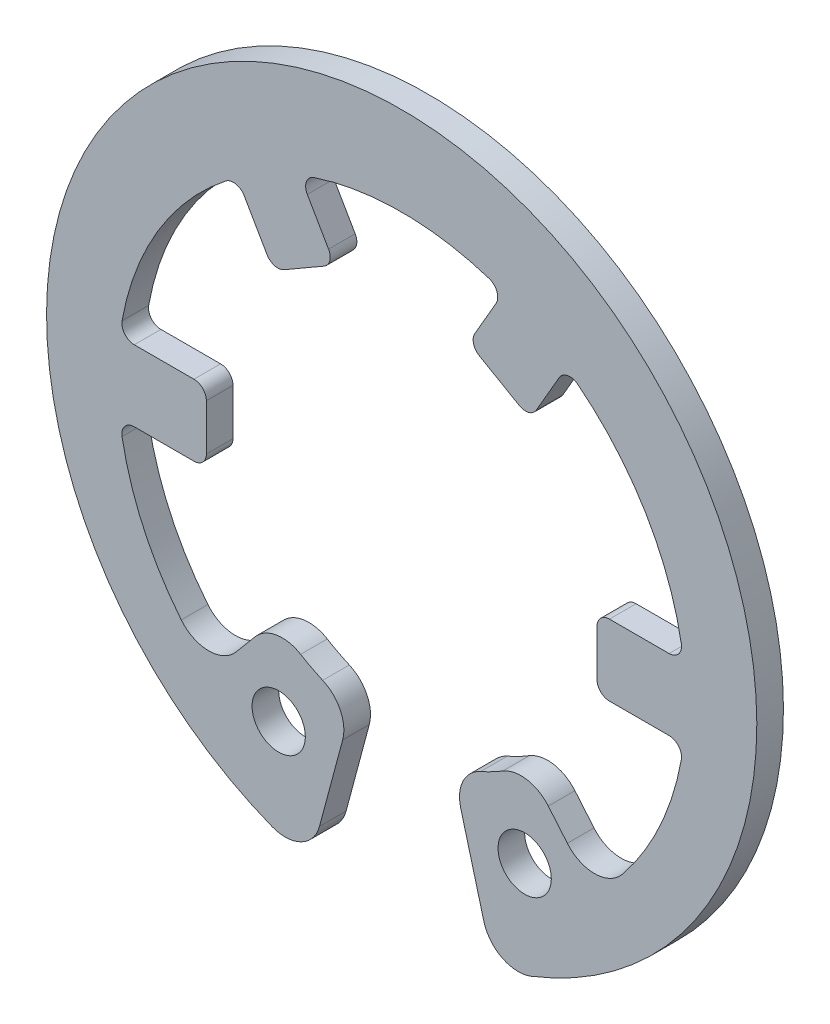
from build123d import *

# Parameters (mm, degrees)
BASE_EXTRUSION_DEPTH    = 0.75
ESQUISSE2_R             = 0.75
ENL_V_MAT_EXTRU_1_DEPTH = 15.162009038


with BuildPart() as part:
    # Esquisse1 → Base-Extrusion (new body)
    with BuildSketch(Plane.XY):
        with BuildLine():
            Line((-7.529940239, 0.5), (-5.85, 0.5))
            ThreePointArc((-5.85, 0.5), (-5.602512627, 0.397487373), (-5.5, 0.15))
            Line((-5.5, 0.15), (-5.5, -1.15))
            ThreePointArc((-5.5, -1.15), (-5.602512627, -1.397487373), (-5.85, -1.5))
            Line((-5.85, -1.5), (-7.529940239, -1.5))
            ThreePointArc((-7.529940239, -1.5), (-7.798377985, -1.625408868), (-7.874447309, -1.911764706))
            ThreePointArc((-7.874447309, -1.911764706), (-7.27146885, -3.83552706), (-6.206701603, -5.547460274))
            ThreePointArc((-6.206701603, -5.547460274), (-5.438552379, -5.916498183), (-4.664819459, -5.559315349))
            Line((-4.664819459, -5.559315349), (-4.128378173, -4.920009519))
            ThreePointArc((-4.128378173, -4.920009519), (-3.526089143, -4.576296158), (-2.845051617, -4.706982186))
            ThreePointArc((-2.845051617, -4.706982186), (-2.539617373, -4.878559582), (-2.223879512, -5.030343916))
            ThreePointArc((-2.223879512, -5.030343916), (-1.726200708, -5.513258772), (-1.662295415, -6.203770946))
            Line((-1.662295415, -6.203770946), (-2.314947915, -8.639503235))
            ThreePointArc((-2.314947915, -8.639503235), (-2.829835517, -9.273188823), (-3.645415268, -9.311871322))
            ThreePointArc((-3.645415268, -9.311871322), (0, 10), (3.645415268, -9.311871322))
            ThreePointArc((3.645415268, -9.311871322), (2.829835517, -9.273188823), (2.314947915, -8.639503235))
            Line((2.314947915, -8.639503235), (1.662295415, -6.203770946))
            ThreePointArc((1.662295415, -6.203770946), (1.726200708, -5.513258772), (2.223879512, -5.030343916))
            ThreePointArc((2.223879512, -5.030343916), (2.539617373, -4.878559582), (2.845051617, -4.706982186))
            ThreePointArc((2.845051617, -4.706982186), (3.526089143, -4.576296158), (4.128378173, -4.920009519))
            Line((4.128378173, -4.920009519), (4.664819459, -5.559315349))
            ThreePointArc((4.664819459, -5.559315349), (5.438552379, -5.916498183), (6.206701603, -5.547460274))
            ThreePointArc((6.206701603, -5.547460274), (7.27146885, -3.83552706), (7.874447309, -1.911764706))
            ThreePointArc((7.874447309, -1.911764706), (7.798377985, -1.625408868), (7.529940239, -1.5))
            Line((7.529940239, -1.5), (5.85, -1.5))
            ThreePointArc((5.85, -1.5), (5.602512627, -1.397487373), (5.5, -1.15))
            Line((5.5, -1.15), (5.5, 0.15))
            ThreePointArc((5.5, 0.15), (5.602512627, 0.397487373), (5.85, 0.5))
            Line((5.85, 0.5), (7.529940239, 0.5))
            ThreePointArc((7.529940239, 0.5), (7.798377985, 0.625408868), (7.874447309, 0.911764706))
            ThreePointArc((7.874447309, 0.911764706), (6.861039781, 3.614138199), (4.954644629, 5.781042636))
            ThreePointArc((4.954644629, 5.781042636), (4.671897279, 5.849971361), (4.434770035, 5.681247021))
            Line((4.434770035, 5.681247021), (3.791025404, 4.566248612))
            ThreePointArc((3.791025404, 4.566248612), (3.578503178, 4.403174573), (3.312916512, 4.438139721))
            Line((3.312916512, 4.438139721), (2.187083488, 5.088139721))
            ThreePointArc((2.187083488, 5.088139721), (2.024009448, 5.300661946), (2.058974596, 5.566248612))
            Line((2.058974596, 5.566248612), (2.657872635, 6.603570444))
            ThreePointArc((2.657872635, 6.603570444), (2.681437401, 6.904206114), (2.462498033, 7.111576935))
            ThreePointArc((2.462498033, 7.111576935), (0, 7.5), (-2.462498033, 7.111576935))
            ThreePointArc((-2.462498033, 7.111576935), (-2.681437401, 6.904206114), (-2.657872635, 6.603570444))
            Line((-2.657872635, 6.603570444), (-2.058974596, 5.566248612))
            ThreePointArc((-2.058974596, 5.566248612), (-2.024009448, 5.300661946), (-2.187083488, 5.088139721))
            Line((-2.187083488, 5.088139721), (-3.312916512, 4.438139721))
            ThreePointArc((-3.312916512, 4.438139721), (-3.578503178, 4.403174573), (-3.791025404, 4.566248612))
            Line((-3.791025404, 4.566248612), (-4.434770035, 5.681247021))
            ThreePointArc((-4.434770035, 5.681247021), (-4.671897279, 5.849971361), (-4.954644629, 5.781042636))
            ThreePointArc((-4.954644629, 5.781042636), (-6.861039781, 3.614138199), (-7.874447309, 0.911764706))
            ThreePointArc((-7.874447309, 0.911764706), (-7.798377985, 0.625408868), (-7.529940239, 0.5))
        make_face()
    extrude(amount=BASE_EXTRUSION_DEPTH)

    # Esquisse2 → Enl_v. mat.-Extru.1 (cut, through all)
    with BuildSketch(Plane.XY.offset(0.75)):
        with Locations((-3.463114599, -6.652581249)):
            Circle(ESQUISSE2_R)
        with Locations((3.463114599, -6.652581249)):
            Circle(ESQUISSE2_R)
    extrude(amount=-ENL_V_MAT_EXTRU_1_DEPTH, mode=Mode.SUBTRACT)


solid = part.part
